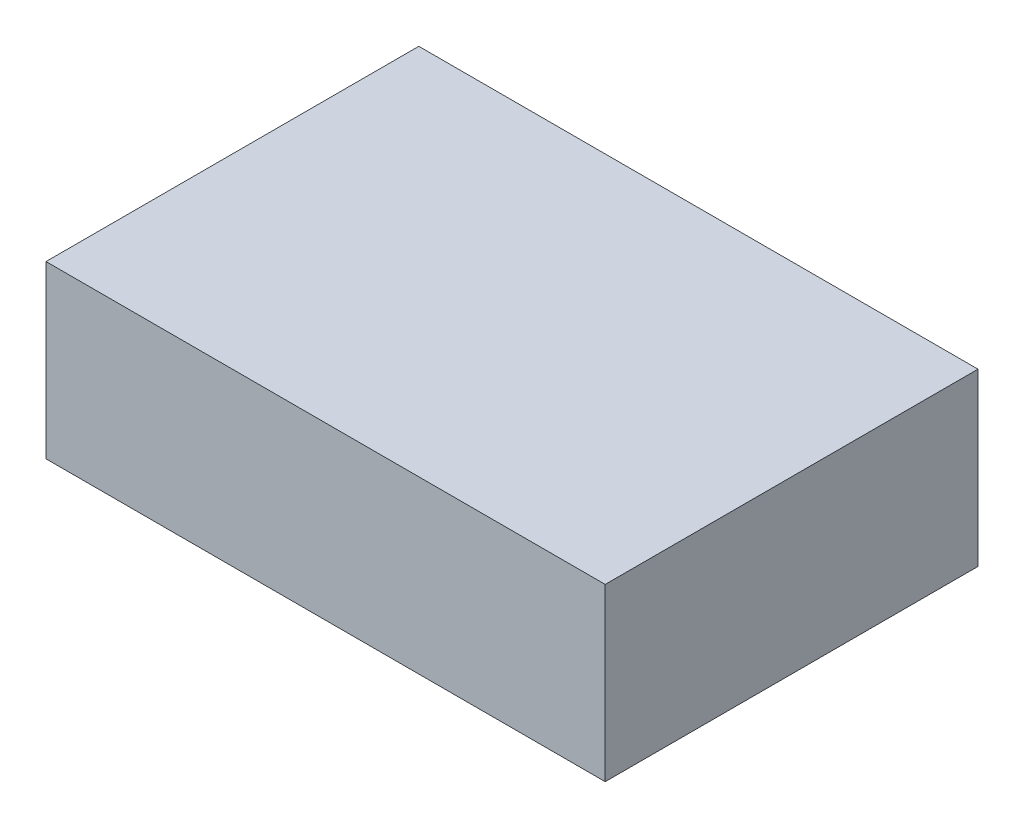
ISO-10303-21;
HEADER;
FILE_DESCRIPTION(('STEP AP214'),'2;1');
FILE_NAME('part.step','',(''),(''),'','','');
FILE_SCHEMA(('AUTOMOTIVE_DESIGN { 1 0 10303 214 1 1 1 1 }'));
ENDSEC;
DATA;
#1=APPLICATION_CONTEXT('core data for automotive mechanical design processes');
#2=APPLICATION_PROTOCOL_DEFINITION('international standard','automotive_design',2000,#1);
#3=PRODUCT_CONTEXT('',#1,'mechanical');
#4=PRODUCT('Part','Part','',(#3));
#5=PRODUCT_RELATED_PRODUCT_CATEGORY('part','',(#4));
#6=PRODUCT_DEFINITION_FORMATION('','',#4);
#7=PRODUCT_DEFINITION_CONTEXT('part definition',#1,'design');
#8=PRODUCT_DEFINITION('design','',#6,#7);
#9=PRODUCT_DEFINITION_SHAPE('','',#8);
#10=(LENGTH_UNIT() NAMED_UNIT(*) SI_UNIT(.MILLI.,.METRE.));
#11=(NAMED_UNIT(*) PLANE_ANGLE_UNIT() SI_UNIT($,.RADIAN.));
#12=(NAMED_UNIT(*) SI_UNIT($,.STERADIAN.) SOLID_ANGLE_UNIT());
#13=UNCERTAINTY_MEASURE_WITH_UNIT(LENGTH_MEASURE(1.E-05),#10,'distance_accuracy_value','');
#14=(GEOMETRIC_REPRESENTATION_CONTEXT(3) GLOBAL_UNCERTAINTY_ASSIGNED_CONTEXT((#13)) GLOBAL_UNIT_ASSIGNED_CONTEXT((#10,
#11,#12)) REPRESENTATION_CONTEXT('',''));
#15=CARTESIAN_POINT('',(0.,0.,0.));
#16=DIRECTION('',(0.,0.,1.));
#17=DIRECTION('',(1.,0.,0.));
#18=AXIS2_PLACEMENT_3D('',#15,#16,#17);
#19=CARTESIAN_POINT('',(0.,13.97,0.));
#20=DIRECTION('',(1.,0.,0.));
#21=DIRECTION('',(0.,0.,-1.));
#22=AXIS2_PLACEMENT_3D('',#19,#20,#21);
#23=PLANE('',#22);
#24=DIRECTION('',(0.,0.,1.));
#25=VECTOR('',#24,1.);
#26=CARTESIAN_POINT('',(0.,0.,0.));
#27=LINE('',#26,#25);
#28=CARTESIAN_POINT('',(0.,0.,-30.48));
#29=VERTEX_POINT('',#28);
#30=CARTESIAN_POINT('',(0.,0.,0.));
#31=VERTEX_POINT('',#30);
#32=EDGE_CURVE('E107',#29,#31,#27,.T.);
#33=ORIENTED_EDGE('',*,*,#32,.T.);
#34=DIRECTION('',(0.,-1.,0.));
#35=VECTOR('',#34,1.);
#36=CARTESIAN_POINT('',(0.,13.97,0.));
#37=LINE('',#36,#35);
#38=CARTESIAN_POINT('',(0.,13.97,0.));
#39=VERTEX_POINT('',#38);
#40=EDGE_CURVE('E11',#39,#31,#37,.T.);
#41=ORIENTED_EDGE('',*,*,#40,.F.);
#42=DIRECTION('',(0.,0.,1.));
#43=VECTOR('',#42,1.);
#44=CARTESIAN_POINT('',(0.,13.97,0.));
#45=LINE('',#44,#43);
#46=CARTESIAN_POINT('',(0.,13.97,-30.48));
#47=VERTEX_POINT('',#46);
#48=EDGE_CURVE('E91',#47,#39,#45,.T.);
#49=ORIENTED_EDGE('',*,*,#48,.F.);
#50=DIRECTION('',(0.,-1.,0.));
#51=VECTOR('',#50,1.);
#52=CARTESIAN_POINT('',(0.,13.97,-30.48));
#53=LINE('',#52,#51);
#54=EDGE_CURVE('E103',#47,#29,#53,.T.);
#55=ORIENTED_EDGE('',*,*,#54,.T.);
#56=EDGE_LOOP('',(#33,#41,#49,#55));
#57=FACE_BOUND('',#56,.T.);
#58=ADVANCED_FACE('F39',(#57),#23,.F.);
#59=CARTESIAN_POINT('',(0.,13.97,0.));
#60=DIRECTION('',(0.,0.,-1.));
#61=DIRECTION('',(-1.,0.,0.));
#62=AXIS2_PLACEMENT_3D('',#59,#60,#61);
#63=PLANE('',#62);
#64=DIRECTION('',(1.,0.,0.));
#65=VECTOR('',#64,1.);
#66=CARTESIAN_POINT('',(0.,0.,0.));
#67=LINE('',#66,#65);
#68=CARTESIAN_POINT('',(45.72,0.,0.));
#69=VERTEX_POINT('',#68);
#70=EDGE_CURVE('E96',#31,#69,#67,.T.);
#71=ORIENTED_EDGE('',*,*,#70,.T.);
#72=DIRECTION('',(0.,-1.,0.));
#73=VECTOR('',#72,1.);
#74=CARTESIAN_POINT('',(45.72,13.97,0.));
#75=LINE('',#74,#73);
#76=CARTESIAN_POINT('',(45.72,13.97,0.));
#77=VERTEX_POINT('',#76);
#78=EDGE_CURVE('E48',#77,#69,#75,.T.);
#79=ORIENTED_EDGE('',*,*,#78,.F.);
#80=DIRECTION('',(1.,0.,0.));
#81=VECTOR('',#80,1.);
#82=CARTESIAN_POINT('',(0.,13.97,0.));
#83=LINE('',#82,#81);
#84=EDGE_CURVE('E86',#39,#77,#83,.T.);
#85=ORIENTED_EDGE('',*,*,#84,.F.);
#86=ORIENTED_EDGE('',*,*,#40,.T.);
#87=EDGE_LOOP('',(#71,#79,#85,#86));
#88=FACE_BOUND('',#87,.T.);
#89=ADVANCED_FACE('F95',(#88),#63,.F.);
#90=CARTESIAN_POINT('',(45.72,13.97,0.));
#91=DIRECTION('',(-1.,0.,0.));
#92=DIRECTION('',(0.,0.,1.));
#93=AXIS2_PLACEMENT_3D('',#90,#91,#92);
#94=PLANE('',#93);
#95=DIRECTION('',(0.,0.,-1.));
#96=VECTOR('',#95,1.);
#97=CARTESIAN_POINT('',(45.72,0.,0.));
#98=LINE('',#97,#96);
#99=CARTESIAN_POINT('',(45.72,0.,-30.48));
#100=VERTEX_POINT('',#99);
#101=EDGE_CURVE('E73',#69,#100,#98,.T.);
#102=ORIENTED_EDGE('',*,*,#101,.T.);
#103=DIRECTION('',(0.,-1.,0.));
#104=VECTOR('',#103,1.);
#105=CARTESIAN_POINT('',(45.72,13.97,-30.48));
#106=LINE('',#105,#104);
#107=CARTESIAN_POINT('',(45.72,13.97,-30.48));
#108=VERTEX_POINT('',#107);
#109=EDGE_CURVE('E98',#108,#100,#106,.T.);
#110=ORIENTED_EDGE('',*,*,#109,.F.);
#111=DIRECTION('',(0.,0.,-1.));
#112=VECTOR('',#111,1.);
#113=CARTESIAN_POINT('',(45.72,13.97,0.));
#114=LINE('',#113,#112);
#115=EDGE_CURVE('E89',#77,#108,#114,.T.);
#116=ORIENTED_EDGE('',*,*,#115,.F.);
#117=ORIENTED_EDGE('',*,*,#78,.T.);
#118=EDGE_LOOP('',(#102,#110,#116,#117));
#119=FACE_BOUND('',#118,.T.);
#120=ADVANCED_FACE('F99',(#119),#94,.F.);
#121=CARTESIAN_POINT('',(0.,13.97,-30.48));
#122=DIRECTION('',(0.,0.,1.));
#123=DIRECTION('',(1.,0.,0.));
#124=AXIS2_PLACEMENT_3D('',#121,#122,#123);
#125=PLANE('',#124);
#126=DIRECTION('',(-1.,0.,0.));
#127=VECTOR('',#126,1.);
#128=CARTESIAN_POINT('',(0.,0.,-30.48));
#129=LINE('',#128,#127);
#130=EDGE_CURVE('E79',#100,#29,#129,.T.);
#131=ORIENTED_EDGE('',*,*,#130,.T.);
#132=ORIENTED_EDGE('',*,*,#54,.F.);
#133=DIRECTION('',(-1.,0.,0.));
#134=VECTOR('',#133,1.);
#135=CARTESIAN_POINT('',(0.,13.97,-30.48));
#136=LINE('',#135,#134);
#137=EDGE_CURVE('E56',#108,#47,#136,.T.);
#138=ORIENTED_EDGE('',*,*,#137,.F.);
#139=ORIENTED_EDGE('',*,*,#109,.T.);
#140=EDGE_LOOP('',(#131,#132,#138,#139));
#141=FACE_BOUND('',#140,.T.);
#142=ADVANCED_FACE('F120',(#141),#125,.F.);
#143=CARTESIAN_POINT('',(0.,13.97,0.));
#144=DIRECTION('',(0.,-1.,0.));
#145=DIRECTION('',(0.,0.,-1.));
#146=AXIS2_PLACEMENT_3D('',#143,#144,#145);
#147=PLANE('',#146);
#148=ORIENTED_EDGE('',*,*,#48,.T.);
#149=ORIENTED_EDGE('',*,*,#84,.T.);
#150=ORIENTED_EDGE('',*,*,#115,.T.);
#151=ORIENTED_EDGE('',*,*,#137,.T.);
#152=EDGE_LOOP('',(#148,#149,#150,#151));
#153=FACE_BOUND('',#152,.T.);
#154=ADVANCED_FACE('F87',(#153),#147,.F.);
#155=CARTESIAN_POINT('',(0.,0.,0.));
#156=DIRECTION('',(0.,-1.,0.));
#157=DIRECTION('',(0.,0.,-1.));
#158=AXIS2_PLACEMENT_3D('',#155,#156,#157);
#159=PLANE('',#158);
#160=ORIENTED_EDGE('',*,*,#32,.F.);
#161=ORIENTED_EDGE('',*,*,#130,.F.);
#162=ORIENTED_EDGE('',*,*,#101,.F.);
#163=ORIENTED_EDGE('',*,*,#70,.F.);
#164=EDGE_LOOP('',(#160,#161,#162,#163));
#165=FACE_BOUND('',#164,.T.);
#166=ADVANCED_FACE('F123',(#165),#159,.T.);
#167=CLOSED_SHELL('',(#58,#89,#120,#142,#154,#166));
#168=MANIFOLD_SOLID_BREP('B2',#167);
#169=ADVANCED_BREP_SHAPE_REPRESENTATION('',(#18,#168),#14);
#170=SHAPE_DEFINITION_REPRESENTATION(#9,#169);
ENDSEC;
END-ISO-10303-21;
